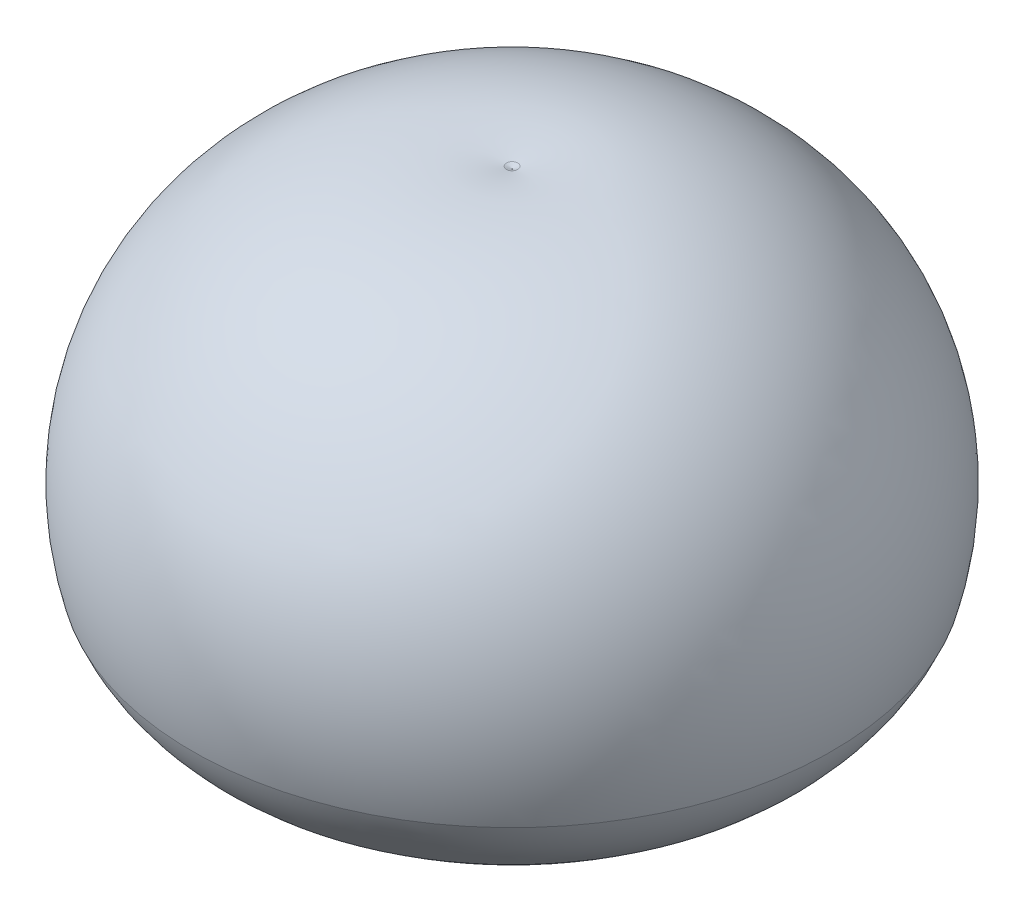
ISO-10303-21;
HEADER;
FILE_DESCRIPTION(('STEP AP214'),'2;1');
FILE_NAME('part.step','',(''),(''),'','','');
FILE_SCHEMA(('AUTOMOTIVE_DESIGN { 1 0 10303 214 1 1 1 1 }'));
ENDSEC;
DATA;
#1=APPLICATION_CONTEXT('core data for automotive mechanical design processes');
#2=APPLICATION_PROTOCOL_DEFINITION('international standard','automotive_design',2000,#1);
#3=PRODUCT_CONTEXT('',#1,'mechanical');
#4=PRODUCT('Part','Part','',(#3));
#5=PRODUCT_RELATED_PRODUCT_CATEGORY('part','',(#4));
#6=PRODUCT_DEFINITION_FORMATION('','',#4);
#7=PRODUCT_DEFINITION_CONTEXT('part definition',#1,'design');
#8=PRODUCT_DEFINITION('design','',#6,#7);
#9=PRODUCT_DEFINITION_SHAPE('','',#8);
#10=(LENGTH_UNIT() NAMED_UNIT(*) SI_UNIT(.MILLI.,.METRE.));
#11=(NAMED_UNIT(*) PLANE_ANGLE_UNIT() SI_UNIT($,.RADIAN.));
#12=(NAMED_UNIT(*) SI_UNIT($,.STERADIAN.) SOLID_ANGLE_UNIT());
#13=UNCERTAINTY_MEASURE_WITH_UNIT(LENGTH_MEASURE(1.E-05),#10,'distance_accuracy_value','');
#14=(GEOMETRIC_REPRESENTATION_CONTEXT(3) GLOBAL_UNCERTAINTY_ASSIGNED_CONTEXT((#13)) GLOBAL_UNIT_ASSIGNED_CONTEXT((#10,
#11,#12)) REPRESENTATION_CONTEXT('',''));
#15=CARTESIAN_POINT('',(0.,0.,0.));
#16=DIRECTION('',(0.,0.,1.));
#17=DIRECTION('',(1.,0.,0.));
#18=AXIS2_PLACEMENT_3D('',#15,#16,#17);
#19=CARTESIAN_POINT('',(0.,1024.11428382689,374.444369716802));
#20=DIRECTION('',(-1.,0.,0.));
#21=DIRECTION('',(0.,0.,-1.));
#22=AXIS2_PLACEMENT_3D('',#19,#20,#21);
#23=CIRCLE('',#22,1125.12621514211);
#24=TRIMMED_CURVE('',#23,(PARAMETER_VALUE(-1.23152281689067)),
(PARAMETER_VALUE(1.23152281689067)),.T.,.PARAMETER.);
#25=CARTESIAN_POINT('',(0.,1024.11428382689,0.));
#26=DIRECTION('',(0.,-1.,0.));
#27=AXIS1_PLACEMENT('',#25,#26);
#28=SURFACE_OF_REVOLUTION('',#24,#27);
#29=CARTESIAN_POINT('',(0.,2085.10458255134,0.));
#30=VERTEX_POINT('',#29);
#31=VERTEX_LOOP('',#30);
#32=FACE_BOUND('',#31,.T.);
#33=CARTESIAN_POINT('',(0.,1350.02814808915,0.));
#34=DIRECTION('',(0.,-1.,0.));
#35=DIRECTION('',(0.,0.,-1.));
#36=AXIS2_PLACEMENT_3D('',#33,#34,#35);
#37=CIRCLE('',#36,702.444274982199);
#38=CARTESIAN_POINT('',(0.,1350.02814808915,-702.444274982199));
#39=VERTEX_POINT('',#38);
#40=EDGE_CURVE('E34',#39,#39,#37,.T.);
#41=ORIENTED_EDGE('',*,*,#40,.T.);
#42=EDGE_LOOP('',(#41));
#43=FACE_BOUND('',#42,.T.);
#44=ADVANCED_FACE('F16',(#32,#43),#28,.F.);
#45=CARTESIAN_POINT('',(0.,1953.74614947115,-294.29011264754));
#46=DIRECTION('',(-1.,0.,0.));
#47=DIRECTION('',(0.,0.,-1.));
#48=AXIS2_PLACEMENT_3D('',#45,#46,#47);
#49=CIRCLE('',#48,749.999999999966);
#50=TRIMMED_CURVE('',#49,(PARAMETER_VALUE(-1.97402141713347)),
(PARAMETER_VALUE(1.97402141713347)),.T.,.PARAMETER.);
#51=CARTESIAN_POINT('',(0.,1953.74614947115,0.));
#52=DIRECTION('',(0.,-1.,0.));
#53=AXIS1_PLACEMENT('',#51,#52);
#54=SURFACE_OF_REVOLUTION('',#50,#53);
#55=CARTESIAN_POINT('',(0.,2658.51561506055,0.));
#56=DIRECTION('',(0.,-1.,0.));
#57=DIRECTION('',(0.,0.,-1.));
#58=AXIS2_PLACEMENT_3D('',#55,#56,#57);
#59=CIRCLE('',#58,37.775005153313);
#60=CARTESIAN_POINT('',(0.,2658.51561506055,-37.775005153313));
#61=VERTEX_POINT('',#60);
#62=EDGE_CURVE('E10',#61,#61,#59,.T.);
#63=ORIENTED_EDGE('',*,*,#62,.F.);
#64=EDGE_LOOP('',(#63));
#65=FACE_BOUND('',#64,.T.);
#66=CARTESIAN_POINT('',(0.,2643.59637205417,0.));
#67=VERTEX_POINT('',#66);
#68=VERTEX_LOOP('',#67);
#69=FACE_BOUND('',#68,.T.);
#70=ADVANCED_FACE('F31',(#65,#69),#54,.T.);
#71=CARTESIAN_POINT('',(0.,830.,0.));
#72=DIRECTION('',(0.,-1.,0.));
#73=DIRECTION('',(0.,0.,-1.));
#74=AXIS2_PLACEMENT_3D('',#71,#72,#73);
#75=DEGENERATE_TOROIDAL_SURFACE('',#74,350.,1854.98080904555,.T.);
#76=CARTESIAN_POINT('',(0.,340.207853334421,0.));
#77=DIRECTION('',(0.,-1.,0.));
#78=DIRECTION('',(0.,0.,-1.));
#79=AXIS2_PLACEMENT_3D('',#76,#77,#78);
#80=CIRCLE('',#79,2139.1499252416);
#81=CARTESIAN_POINT('',(0.,340.207853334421,-2139.1499252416));
#82=VERTEX_POINT('',#81);
#83=EDGE_CURVE('E23',#82,#82,#80,.T.);
#84=ORIENTED_EDGE('',*,*,#83,.F.);
#85=EDGE_LOOP('',(#84));
#86=FACE_BOUND('',#85,.T.);
#87=ORIENTED_EDGE('',*,*,#62,.T.);
#88=EDGE_LOOP('',(#87));
#89=FACE_BOUND('',#88,.T.);
#90=ADVANCED_FACE('F48',(#86,#89),#75,.T.);
#91=CARTESIAN_POINT('',(0.,764.633192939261,0.));
#92=DIRECTION('',(0.,-1.,0.));
#93=DIRECTION('',(0.,0.,-1.));
#94=AXIS2_PLACEMENT_3D('',#91,#92,#93);
#95=DEGENERATE_TOROIDAL_SURFACE('',#94,1097.14602356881,1125.12621514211,.T.);
#96=CARTESIAN_POINT('',(0.,-236.414463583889,0.));
#97=DIRECTION('',(0.,-1.,0.));
#98=DIRECTION('',(0.,0.,-1.));
#99=AXIS2_PLACEMENT_3D('',#96,#97,#98);
#100=CIRCLE('',#99,583.519126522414);
#101=CARTESIAN_POINT('',(0.,-236.414463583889,-583.519126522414));
#102=VERTEX_POINT('',#101);
#103=EDGE_CURVE('E39',#102,#102,#100,.T.);
#104=ORIENTED_EDGE('',*,*,#103,.F.);
#105=EDGE_LOOP('',(#104));
#106=FACE_BOUND('',#105,.T.);
#107=ORIENTED_EDGE('',*,*,#83,.T.);
#108=EDGE_LOOP('',(#107));
#109=FACE_BOUND('',#108,.T.);
#110=ADVANCED_FACE('F46',(#106,#109),#95,.T.);
#111=CARTESIAN_POINT('',(0.,0.,0.));
#112=DIRECTION('',(0.,-1.,0.));
#113=DIRECTION('',(0.,0.,-1.));
#114=AXIS2_PLACEMENT_3D('',#111,#112,#113);
#115=CYLINDRICAL_SURFACE('',#114,583.519126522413);
#116=CARTESIAN_POINT('',(0.,246.806156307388,0.));
#117=DIRECTION('',(0.,-1.,0.));
#118=DIRECTION('',(0.,0.,-1.));
#119=AXIS2_PLACEMENT_3D('',#116,#117,#118);
#120=CIRCLE('',#119,583.519126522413);
#121=CARTESIAN_POINT('',(0.,246.806156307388,-583.519126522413));
#122=VERTEX_POINT('',#121);
#123=EDGE_CURVE('E36',#122,#122,#120,.T.);
#124=ORIENTED_EDGE('',*,*,#123,.F.);
#125=EDGE_LOOP('',(#124));
#126=FACE_BOUND('',#125,.T.);
#127=ORIENTED_EDGE('',*,*,#103,.T.);
#128=EDGE_LOOP('',(#127));
#129=FACE_BOUND('',#128,.T.);
#130=ADVANCED_FACE('F62',(#126,#129),#115,.F.);
#131=CARTESIAN_POINT('',(0.,830.,0.));
#132=DIRECTION('',(0.,-1.,0.));
#133=DIRECTION('',(0.,0.,-1.));
#134=AXIS2_PLACEMENT_3D('',#131,#132,#133);
#135=DEGENERATE_TOROIDAL_SURFACE('',#134,350.,628.208756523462,.T.);
#136=ORIENTED_EDGE('',*,*,#40,.F.);
#137=EDGE_LOOP('',(#136));
#138=FACE_BOUND('',#137,.T.);
#139=ORIENTED_EDGE('',*,*,#123,.T.);
#140=EDGE_LOOP('',(#139));
#141=FACE_BOUND('',#140,.T.);
#142=ADVANCED_FACE('F66',(#138,#141),#135,.F.);
#143=CLOSED_SHELL('',(#44,#70,#90,#110,#130,#142));
#144=MANIFOLD_SOLID_BREP('B1',#143);
#145=ADVANCED_BREP_SHAPE_REPRESENTATION('',(#18,#144),#14);
#146=SHAPE_DEFINITION_REPRESENTATION(#9,#145);
ENDSEC;
END-ISO-10303-21;
